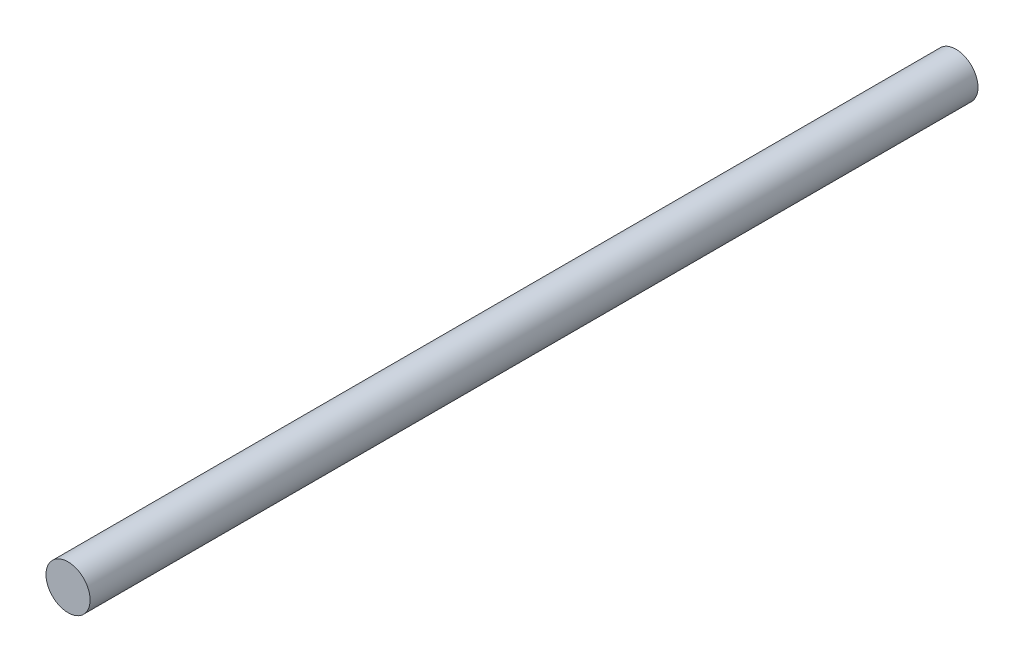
ISO-10303-21;
HEADER;
FILE_DESCRIPTION(('STEP AP214'),'2;1');
FILE_NAME('part.step','',(''),(''),'','','');
FILE_SCHEMA(('AUTOMOTIVE_DESIGN { 1 0 10303 214 1 1 1 1 }'));
ENDSEC;
DATA;
#1=APPLICATION_CONTEXT('core data for automotive mechanical design processes');
#2=APPLICATION_PROTOCOL_DEFINITION('international standard','automotive_design',2000,#1);
#3=PRODUCT_CONTEXT('',#1,'mechanical');
#4=PRODUCT('Part','Part','',(#3));
#5=PRODUCT_RELATED_PRODUCT_CATEGORY('part','',(#4));
#6=PRODUCT_DEFINITION_FORMATION('','',#4);
#7=PRODUCT_DEFINITION_CONTEXT('part definition',#1,'design');
#8=PRODUCT_DEFINITION('design','',#6,#7);
#9=PRODUCT_DEFINITION_SHAPE('','',#8);
#10=(LENGTH_UNIT() NAMED_UNIT(*) SI_UNIT(.MILLI.,.METRE.));
#11=(NAMED_UNIT(*) PLANE_ANGLE_UNIT() SI_UNIT($,.RADIAN.));
#12=(NAMED_UNIT(*) SI_UNIT($,.STERADIAN.) SOLID_ANGLE_UNIT());
#13=UNCERTAINTY_MEASURE_WITH_UNIT(LENGTH_MEASURE(1.E-05),#10,'distance_accuracy_value','');
#14=(GEOMETRIC_REPRESENTATION_CONTEXT(3) GLOBAL_UNCERTAINTY_ASSIGNED_CONTEXT((#13)) GLOBAL_UNIT_ASSIGNED_CONTEXT((#10,
#11,#12)) REPRESENTATION_CONTEXT('',''));
#15=CARTESIAN_POINT('',(0.,0.,0.));
#16=DIRECTION('',(0.,0.,1.));
#17=DIRECTION('',(1.,0.,0.));
#18=AXIS2_PLACEMENT_3D('',#15,#16,#17);
#19=CARTESIAN_POINT('',(0.,0.,32.207526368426));
#20=DIRECTION('',(0.,0.,1.));
#21=DIRECTION('',(1.,0.,0.));
#22=AXIS2_PLACEMENT_3D('',#19,#20,#21);
#23=PLANE('',#22);
#24=CARTESIAN_POINT('',(0.,0.,32.207526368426));
#25=DIRECTION('',(0.,0.,-1.));
#26=DIRECTION('',(-1.,0.,0.));
#27=AXIS2_PLACEMENT_3D('',#24,#25,#26);
#28=CIRCLE('',#27,1.6);
#29=CARTESIAN_POINT('',(-1.6,0.,32.207526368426));
#30=VERTEX_POINT('',#29);
#31=EDGE_CURVE('E10',#30,#30,#28,.T.);
#32=ORIENTED_EDGE('',*,*,#31,.F.);
#33=EDGE_LOOP('',(#32));
#34=FACE_BOUND('',#33,.T.);
#35=ADVANCED_FACE('F15',(#34),#23,.T.);
#36=CARTESIAN_POINT('',(0.,0.,-32.207526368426));
#37=DIRECTION('',(0.,0.,-1.));
#38=DIRECTION('',(-1.,0.,0.));
#39=AXIS2_PLACEMENT_3D('',#36,#37,#38);
#40=PLANE('',#39);
#41=CARTESIAN_POINT('',(0.,0.,-32.207526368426));
#42=DIRECTION('',(0.,0.,1.));
#43=DIRECTION('',(1.,0.,0.));
#44=AXIS2_PLACEMENT_3D('',#41,#42,#43);
#45=CIRCLE('',#44,1.6);
#46=CARTESIAN_POINT('',(1.6,0.,-32.207526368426));
#47=VERTEX_POINT('',#46);
#48=EDGE_CURVE('E22',#47,#47,#45,.T.);
#49=ORIENTED_EDGE('',*,*,#48,.F.);
#50=EDGE_LOOP('',(#49));
#51=FACE_BOUND('',#50,.T.);
#52=ADVANCED_FACE('F26',(#51),#40,.T.);
#53=CARTESIAN_POINT('',(0.,0.,-32.207526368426));
#54=DIRECTION('',(0.,0.,1.));
#55=DIRECTION('',(1.,0.,0.));
#56=AXIS2_PLACEMENT_3D('',#53,#54,#55);
#57=CYLINDRICAL_SURFACE('',#56,1.6);
#58=ORIENTED_EDGE('',*,*,#31,.T.);
#59=EDGE_LOOP('',(#58));
#60=FACE_BOUND('',#59,.T.);
#61=ORIENTED_EDGE('',*,*,#48,.T.);
#62=EDGE_LOOP('',(#61));
#63=FACE_BOUND('',#62,.T.);
#64=ADVANCED_FACE('F17',(#60,#63),#57,.T.);
#65=CLOSED_SHELL('',(#35,#52,#64));
#66=MANIFOLD_SOLID_BREP('B1',#65);
#67=ADVANCED_BREP_SHAPE_REPRESENTATION('',(#18,#66),#14);
#68=SHAPE_DEFINITION_REPRESENTATION(#9,#67);
ENDSEC;
END-ISO-10303-21;
